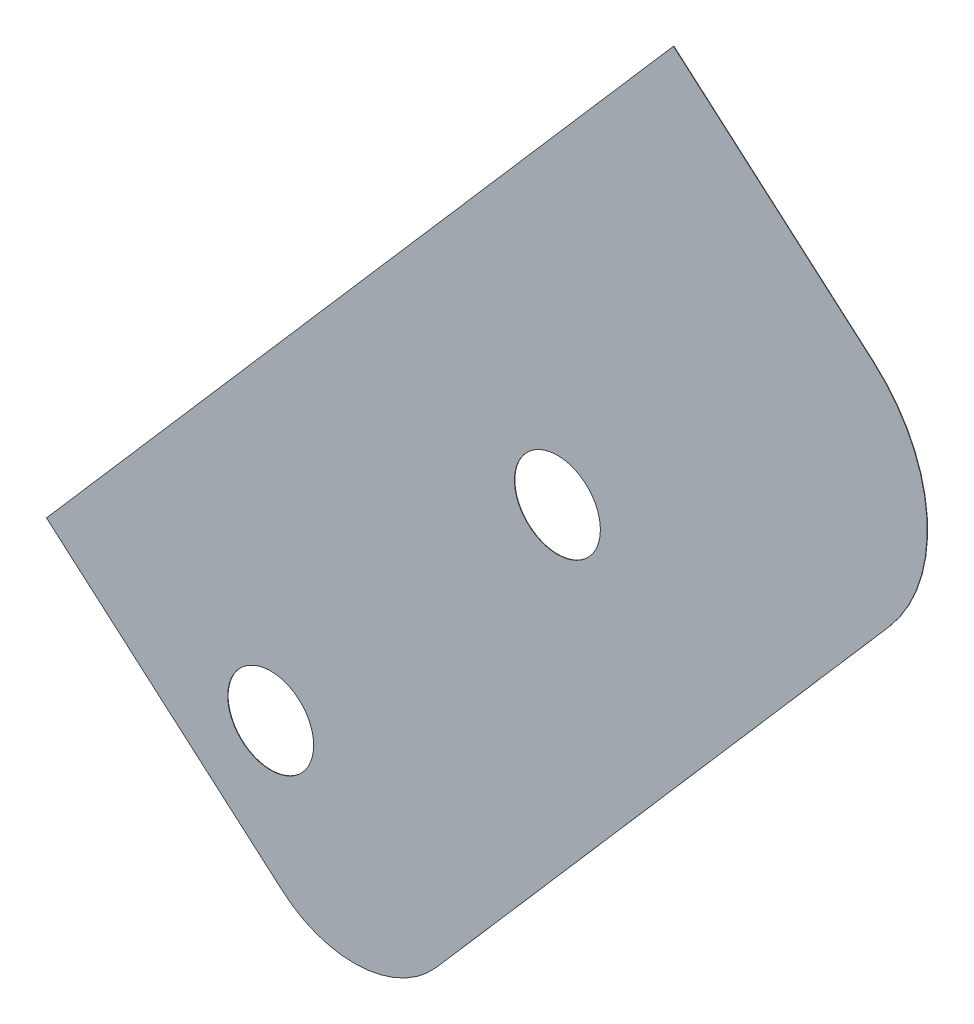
ISO-10303-21;
HEADER;
FILE_DESCRIPTION(('STEP AP214'),'2;1');
FILE_NAME('part.step','',(''),(''),'','','');
FILE_SCHEMA(('AUTOMOTIVE_DESIGN { 1 0 10303 214 1 1 1 1 }'));
ENDSEC;
DATA;
#1=APPLICATION_CONTEXT('core data for automotive mechanical design processes');
#2=APPLICATION_PROTOCOL_DEFINITION('international standard','automotive_design',2000,#1);
#3=PRODUCT_CONTEXT('',#1,'mechanical');
#4=PRODUCT('Part','Part','',(#3));
#5=PRODUCT_RELATED_PRODUCT_CATEGORY('part','',(#4));
#6=PRODUCT_DEFINITION_FORMATION('','',#4);
#7=PRODUCT_DEFINITION_CONTEXT('part definition',#1,'design');
#8=PRODUCT_DEFINITION('design','',#6,#7);
#9=PRODUCT_DEFINITION_SHAPE('','',#8);
#10=(LENGTH_UNIT() NAMED_UNIT(*) SI_UNIT(.MILLI.,.METRE.));
#11=(NAMED_UNIT(*) PLANE_ANGLE_UNIT() SI_UNIT($,.RADIAN.));
#12=(NAMED_UNIT(*) SI_UNIT($,.STERADIAN.) SOLID_ANGLE_UNIT());
#13=UNCERTAINTY_MEASURE_WITH_UNIT(LENGTH_MEASURE(1.E-05),#10,'distance_accuracy_value','');
#14=(GEOMETRIC_REPRESENTATION_CONTEXT(3) GLOBAL_UNCERTAINTY_ASSIGNED_CONTEXT((#13)) GLOBAL_UNIT_ASSIGNED_CONTEXT((#10,
#11,#12)) REPRESENTATION_CONTEXT('',''));
#15=CARTESIAN_POINT('',(0.,0.,0.));
#16=DIRECTION('',(0.,0.,1.));
#17=DIRECTION('',(1.,0.,0.));
#18=AXIS2_PLACEMENT_3D('',#15,#16,#17);
#19=CARTESIAN_POINT('',(-628.695624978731,-74.2116467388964,0.0254000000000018));
#20=DIRECTION('',(0.,0.,-1.));
#21=DIRECTION('',(-1.,0.,0.));
#22=AXIS2_PLACEMENT_3D('',#19,#20,#21);
#23=CYLINDRICAL_SURFACE('',#22,10.287);
#24=CARTESIAN_POINT('',(-628.695624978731,-74.2116467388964,0.));
#25=DIRECTION('',(0.,0.,1.));
#26=DIRECTION('',(1.,0.,0.));
#27=AXIS2_PLACEMENT_3D('',#24,#25,#26);
#28=CIRCLE('',#27,10.287);
#29=CARTESIAN_POINT('',(-620.928630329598,-80.9567311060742,0.));
#30=VERTEX_POINT('',#29);
#31=CARTESIAN_POINT('',(-621.950540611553,-66.4446520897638,0.));
#32=VERTEX_POINT('',#31);
#33=EDGE_CURVE('E135',#30,#32,#28,.T.);
#34=ORIENTED_EDGE('',*,*,#33,.T.);
#35=DIRECTION('',(0.,0.,-1.));
#36=VECTOR('',#35,1.);
#37=CARTESIAN_POINT('',(-621.950540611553,-66.4446520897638,0.0254000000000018));
#38=LINE('',#37,#36);
#39=CARTESIAN_POINT('',(-621.950540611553,-66.4446520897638,0.0254000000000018));
#40=VERTEX_POINT('',#39);
#41=EDGE_CURVE('E11',#40,#32,#38,.T.);
#42=ORIENTED_EDGE('',*,*,#41,.F.);
#43=CARTESIAN_POINT('',(-628.695624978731,-74.2116467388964,0.0254000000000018));
#44=DIRECTION('',(0.,0.,1.));
#45=DIRECTION('',(1.,0.,0.));
#46=AXIS2_PLACEMENT_3D('',#43,#44,#45);
#47=CIRCLE('',#46,10.287);
#48=CARTESIAN_POINT('',(-620.928630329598,-80.9567311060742,0.0254000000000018));
#49=VERTEX_POINT('',#48);
#50=EDGE_CURVE('E152',#49,#40,#47,.T.);
#51=ORIENTED_EDGE('',*,*,#50,.F.);
#52=DIRECTION('',(0.,0.,-1.));
#53=VECTOR('',#52,1.);
#54=CARTESIAN_POINT('',(-620.928630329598,-80.9567311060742,0.0254000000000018));
#55=LINE('',#54,#53);
#56=EDGE_CURVE('E131',#49,#30,#55,.T.);
#57=ORIENTED_EDGE('',*,*,#56,.T.);
#58=EDGE_LOOP('',(#34,#42,#51,#57));
#59=FACE_BOUND('',#58,.T.);
#60=ADVANCED_FACE('F45',(#59),#23,.T.);
#61=CARTESIAN_POINT('',(-621.950540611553,-66.4446520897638,0.0254000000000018));
#62=DIRECTION('',(-0.655690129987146,-0.755030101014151,0.));
#63=DIRECTION('',(0.755030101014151,-0.655690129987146,0.));
#64=AXIS2_PLACEMENT_3D('',#61,#62,#63);
#65=PLANE('',#64);
#66=DIRECTION('',(-0.755030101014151,0.655690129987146,0.));
#67=VECTOR('',#66,1.);
#68=CARTESIAN_POINT('',(-621.950540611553,-66.4446520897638,0.));
#69=LINE('',#68,#67);
#70=CARTESIAN_POINT('',(-634.991420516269,-55.1195721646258,0.));
#71=VERTEX_POINT('',#70);
#72=EDGE_CURVE('E139',#32,#71,#69,.T.);
#73=ORIENTED_EDGE('',*,*,#72,.T.);
#74=DIRECTION('',(0.,0.,-1.));
#75=VECTOR('',#74,1.);
#76=CARTESIAN_POINT('',(-634.991420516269,-55.1195721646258,0.0254000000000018));
#77=LINE('',#76,#75);
#78=CARTESIAN_POINT('',(-634.991420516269,-55.1195721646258,0.0254000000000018));
#79=VERTEX_POINT('',#78);
#80=EDGE_CURVE('E54',#79,#71,#77,.T.);
#81=ORIENTED_EDGE('',*,*,#80,.F.);
#82=DIRECTION('',(-0.755030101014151,0.655690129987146,0.));
#83=VECTOR('',#82,1.);
#84=CARTESIAN_POINT('',(-621.950540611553,-66.4446520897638,0.0254000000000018));
#85=LINE('',#84,#83);
#86=EDGE_CURVE('E99',#40,#79,#85,.T.);
#87=ORIENTED_EDGE('',*,*,#86,.F.);
#88=ORIENTED_EDGE('',*,*,#41,.T.);
#89=EDGE_LOOP('',(#73,#81,#87,#88));
#90=FACE_BOUND('',#89,.T.);
#91=ADVANCED_FACE('F182',(#90),#65,.F.);
#92=CARTESIAN_POINT('',(-634.991420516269,-55.1195721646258,0.0254000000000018));
#93=DIRECTION('',(0.755030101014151,-0.655690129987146,0.));
#94=DIRECTION('',(0.655690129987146,0.755030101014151,0.));
#95=AXIS2_PLACEMENT_3D('',#92,#93,#94);
#96=PLANE('',#95);
#97=DIRECTION('',(-0.655690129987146,-0.755030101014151,0.));
#98=VECTOR('',#97,1.);
#99=CARTESIAN_POINT('',(-634.991420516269,-55.1195721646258,0.));
#100=LINE('',#99,#98);
#101=CARTESIAN_POINT('',(-675.961562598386,-102.296872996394,0.));
#102=VERTEX_POINT('',#101);
#103=EDGE_CURVE('E143',#71,#102,#100,.T.);
#104=ORIENTED_EDGE('',*,*,#103,.T.);
#105=DIRECTION('',(0.,0.,-1.));
#106=VECTOR('',#105,1.);
#107=CARTESIAN_POINT('',(-675.961562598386,-102.296872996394,0.0254000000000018));
#108=LINE('',#107,#106);
#109=CARTESIAN_POINT('',(-675.961562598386,-102.296872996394,0.0254000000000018));
#110=VERTEX_POINT('',#109);
#111=EDGE_CURVE('E123',#110,#102,#108,.T.);
#112=ORIENTED_EDGE('',*,*,#111,.F.);
#113=DIRECTION('',(-0.655690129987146,-0.755030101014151,0.));
#114=VECTOR('',#113,1.);
#115=CARTESIAN_POINT('',(-634.991420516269,-55.1195721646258,0.0254000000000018));
#116=LINE('',#115,#114);
#117=EDGE_CURVE('E112',#79,#110,#116,.T.);
#118=ORIENTED_EDGE('',*,*,#117,.F.);
#119=ORIENTED_EDGE('',*,*,#80,.T.);
#120=EDGE_LOOP('',(#104,#112,#118,#119));
#121=FACE_BOUND('',#120,.T.);
#122=ADVANCED_FACE('F163',(#121),#96,.F.);
#123=CARTESIAN_POINT('',(-675.961562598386,-102.296872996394,0.0254000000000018));
#124=DIRECTION('',(0.655690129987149,0.755030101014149,0.));
#125=DIRECTION('',(-0.755030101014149,0.655690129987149,0.));
#126=AXIS2_PLACEMENT_3D('',#123,#124,#125);
#127=PLANE('',#126);
#128=DIRECTION('',(0.755030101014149,-0.655690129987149,0.));
#129=VECTOR('',#128,1.);
#130=CARTESIAN_POINT('',(-675.961562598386,-102.296872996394,0.));
#131=LINE('',#130,#129);
#132=CARTESIAN_POINT('',(-660.52346212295,-115.703769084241,0.));
#133=VERTEX_POINT('',#132);
#134=EDGE_CURVE('E121',#102,#133,#131,.T.);
#135=ORIENTED_EDGE('',*,*,#134,.T.);
#136=DIRECTION('',(0.,0.,-1.));
#137=VECTOR('',#136,1.);
#138=CARTESIAN_POINT('',(-660.52346212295,-115.703769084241,0.0254000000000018));
#139=LINE('',#138,#137);
#140=CARTESIAN_POINT('',(-660.52346212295,-115.703769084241,0.0254000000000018));
#141=VERTEX_POINT('',#140);
#142=EDGE_CURVE('E118',#141,#133,#139,.T.);
#143=ORIENTED_EDGE('',*,*,#142,.F.);
#144=DIRECTION('',(0.755030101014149,-0.655690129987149,0.));
#145=VECTOR('',#144,1.);
#146=CARTESIAN_POINT('',(-675.961562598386,-102.296872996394,0.0254000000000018));
#147=LINE('',#146,#145);
#148=EDGE_CURVE('E106',#110,#141,#147,.T.);
#149=ORIENTED_EDGE('',*,*,#148,.F.);
#150=ORIENTED_EDGE('',*,*,#111,.T.);
#151=EDGE_LOOP('',(#135,#143,#149,#150));
#152=FACE_BOUND('',#151,.T.);
#153=ADVANCED_FACE('F119',(#152),#127,.F.);
#154=CARTESIAN_POINT('',(-655.860193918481,-110.333995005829,0.0254000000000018));
#155=DIRECTION('',(0.,0.,-1.));
#156=DIRECTION('',(-1.,0.,0.));
#157=AXIS2_PLACEMENT_3D('',#154,#155,#156);
#158=CYLINDRICAL_SURFACE('',#157,7.11200000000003);
#159=CARTESIAN_POINT('',(-655.860193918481,-110.333995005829,0.));
#160=DIRECTION('',(0.,0.,1.));
#161=DIRECTION('',(1.,0.,0.));
#162=AXIS2_PLACEMENT_3D('',#159,#160,#161);
#163=CIRCLE('',#162,7.11200000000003);
#164=CARTESIAN_POINT('',(-650.490419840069,-114.997263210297,0.));
#165=VERTEX_POINT('',#164);
#166=EDGE_CURVE('E85',#133,#165,#163,.T.);
#167=ORIENTED_EDGE('',*,*,#166,.T.);
#168=DIRECTION('',(0.,0.,-1.));
#169=VECTOR('',#168,1.);
#170=CARTESIAN_POINT('',(-650.490419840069,-114.997263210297,0.0254000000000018));
#171=LINE('',#170,#169);
#172=CARTESIAN_POINT('',(-650.490419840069,-114.997263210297,0.0254000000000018));
#173=VERTEX_POINT('',#172);
#174=EDGE_CURVE('E124',#173,#165,#171,.T.);
#175=ORIENTED_EDGE('',*,*,#174,.F.);
#176=CARTESIAN_POINT('',(-655.860193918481,-110.333995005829,0.0254000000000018));
#177=DIRECTION('',(0.,0.,1.));
#178=DIRECTION('',(1.,0.,0.));
#179=AXIS2_PLACEMENT_3D('',#176,#177,#178);
#180=CIRCLE('',#179,7.11200000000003);
#181=EDGE_CURVE('E110',#141,#173,#180,.T.);
#182=ORIENTED_EDGE('',*,*,#181,.F.);
#183=ORIENTED_EDGE('',*,*,#142,.T.);
#184=EDGE_LOOP('',(#167,#175,#182,#183));
#185=FACE_BOUND('',#184,.T.);
#186=ADVANCED_FACE('F126',(#185),#158,.T.);
#187=CARTESIAN_POINT('',(-650.490419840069,-114.997263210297,0.0254000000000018));
#188=DIRECTION('',(-0.755030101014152,0.655690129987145,0.));
#189=DIRECTION('',(-0.655690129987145,-0.755030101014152,0.));
#190=AXIS2_PLACEMENT_3D('',#187,#188,#189);
#191=PLANE('',#190);
#192=DIRECTION('',(0.655690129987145,0.755030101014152,0.));
#193=VECTOR('',#192,1.);
#194=CARTESIAN_POINT('',(-650.490419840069,-114.997263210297,0.));
#195=LINE('',#194,#193);
#196=EDGE_CURVE('E91',#165,#30,#195,.T.);
#197=ORIENTED_EDGE('',*,*,#196,.T.);
#198=ORIENTED_EDGE('',*,*,#56,.F.);
#199=DIRECTION('',(0.655690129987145,0.755030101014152,0.));
#200=VECTOR('',#199,1.);
#201=CARTESIAN_POINT('',(-650.490419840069,-114.997263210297,0.0254000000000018));
#202=LINE('',#201,#200);
#203=EDGE_CURVE('E62',#173,#49,#202,.T.);
#204=ORIENTED_EDGE('',*,*,#203,.F.);
#205=ORIENTED_EDGE('',*,*,#174,.T.);
#206=EDGE_LOOP('',(#197,#198,#204,#205));
#207=FACE_BOUND('',#206,.T.);
#208=ADVANCED_FACE('F170',(#207),#191,.F.);
#209=CARTESIAN_POINT('',(-628.695624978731,-74.2116467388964,0.0254000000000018));
#210=DIRECTION('',(0.,0.,1.));
#211=DIRECTION('',(1.,0.,0.));
#212=AXIS2_PLACEMENT_3D('',#209,#210,#211);
#213=PLANE('',#212);
#214=CARTESIAN_POINT('',(-661.310720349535,-106.441625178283,0.0254000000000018));
#215=DIRECTION('',(0.,0.,1.));
#216=DIRECTION('',(1.,0.,0.));
#217=AXIS2_PLACEMENT_3D('',#214,#215,#216);
#218=CIRCLE('',#217,2.80670000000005);
#219=CARTESIAN_POINT('',(-658.504020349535,-106.441625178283,0.0254000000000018));
#220=VERTEX_POINT('',#219);
#221=EDGE_CURVE('E253',#220,#220,#218,.T.);
#222=ORIENTED_EDGE('',*,*,#221,.F.);
#223=EDGE_LOOP('',(#222));
#224=FACE_BOUND('',#223,.T.);
#225=CARTESIAN_POINT('',(-642.574374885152,-84.8666400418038,0.0254000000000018));
#226=DIRECTION('',(0.,0.,1.));
#227=DIRECTION('',(1.,0.,0.));
#228=AXIS2_PLACEMENT_3D('',#225,#226,#227);
#229=CIRCLE('',#228,2.80670000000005);
#230=CARTESIAN_POINT('',(-639.767674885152,-84.8666400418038,0.0254000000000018));
#231=VERTEX_POINT('',#230);
#232=EDGE_CURVE('E140',#231,#231,#229,.T.);
#233=ORIENTED_EDGE('',*,*,#232,.F.);
#234=EDGE_LOOP('',(#233));
#235=FACE_BOUND('',#234,.T.);
#236=ORIENTED_EDGE('',*,*,#50,.T.);
#237=ORIENTED_EDGE('',*,*,#86,.T.);
#238=ORIENTED_EDGE('',*,*,#117,.T.);
#239=ORIENTED_EDGE('',*,*,#148,.T.);
#240=ORIENTED_EDGE('',*,*,#181,.T.);
#241=ORIENTED_EDGE('',*,*,#203,.T.);
#242=EDGE_LOOP('',(#236,#237,#238,#239,#240,#241));
#243=FACE_BOUND('',#242,.T.);
#244=ADVANCED_FACE('F108',(#224,#235,#243),#213,.T.);
#245=CARTESIAN_POINT('',(-628.695624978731,-74.2116467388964,0.));
#246=DIRECTION('',(0.,0.,1.));
#247=DIRECTION('',(1.,0.,0.));
#248=AXIS2_PLACEMENT_3D('',#245,#246,#247);
#249=PLANE('',#248);
#250=CARTESIAN_POINT('',(-661.310720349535,-106.441625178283,0.));
#251=DIRECTION('',(0.,0.,1.));
#252=DIRECTION('',(1.,0.,0.));
#253=AXIS2_PLACEMENT_3D('',#250,#251,#252);
#254=CIRCLE('',#253,2.80670000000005);
#255=CARTESIAN_POINT('',(-658.504020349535,-106.441625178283,0.));
#256=VERTEX_POINT('',#255);
#257=EDGE_CURVE('E250',#256,#256,#254,.T.);
#258=ORIENTED_EDGE('',*,*,#257,.T.);
#259=EDGE_LOOP('',(#258));
#260=FACE_BOUND('',#259,.T.);
#261=CARTESIAN_POINT('',(-642.574374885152,-84.8666400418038,0.));
#262=DIRECTION('',(0.,0.,1.));
#263=DIRECTION('',(1.,0.,0.));
#264=AXIS2_PLACEMENT_3D('',#261,#262,#263);
#265=CIRCLE('',#264,2.80670000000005);
#266=CARTESIAN_POINT('',(-639.767674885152,-84.8666400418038,0.));
#267=VERTEX_POINT('',#266);
#268=EDGE_CURVE('E255',#267,#267,#265,.T.);
#269=ORIENTED_EDGE('',*,*,#268,.T.);
#270=EDGE_LOOP('',(#269));
#271=FACE_BOUND('',#270,.T.);
#272=ORIENTED_EDGE('',*,*,#33,.F.);
#273=ORIENTED_EDGE('',*,*,#196,.F.);
#274=ORIENTED_EDGE('',*,*,#166,.F.);
#275=ORIENTED_EDGE('',*,*,#134,.F.);
#276=ORIENTED_EDGE('',*,*,#103,.F.);
#277=ORIENTED_EDGE('',*,*,#72,.F.);
#278=EDGE_LOOP('',(#272,#273,#274,#275,#276,#277));
#279=FACE_BOUND('',#278,.T.);
#280=ADVANCED_FACE('F166',(#260,#271,#279),#249,.F.);
#281=CARTESIAN_POINT('',(-642.574374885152,-84.8666400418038,0.0254000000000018));
#282=DIRECTION('',(0.,0.,1.));
#283=DIRECTION('',(1.,0.,0.));
#284=AXIS2_PLACEMENT_3D('',#281,#282,#283);
#285=CYLINDRICAL_SURFACE('',#284,2.80670000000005);
#286=ORIENTED_EDGE('',*,*,#268,.F.);
#287=EDGE_LOOP('',(#286));
#288=FACE_BOUND('',#287,.T.);
#289=ORIENTED_EDGE('',*,*,#232,.T.);
#290=EDGE_LOOP('',(#289));
#291=FACE_BOUND('',#290,.T.);
#292=ADVANCED_FACE('F221',(#288,#291),#285,.F.);
#293=CARTESIAN_POINT('',(-661.310720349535,-106.441625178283,0.0254000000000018));
#294=DIRECTION('',(0.,0.,1.));
#295=DIRECTION('',(1.,0.,0.));
#296=AXIS2_PLACEMENT_3D('',#293,#294,#295);
#297=CYLINDRICAL_SURFACE('',#296,2.80670000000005);
#298=ORIENTED_EDGE('',*,*,#257,.F.);
#299=EDGE_LOOP('',(#298));
#300=FACE_BOUND('',#299,.T.);
#301=ORIENTED_EDGE('',*,*,#221,.T.);
#302=EDGE_LOOP('',(#301));
#303=FACE_BOUND('',#302,.T.);
#304=ADVANCED_FACE('F231',(#300,#303),#297,.F.);
#305=CLOSED_SHELL('',(#60,#91,#122,#153,#186,#208,#244,#280,#292,#304));
#306=MANIFOLD_SOLID_BREP('B2',#305);
#307=ADVANCED_BREP_SHAPE_REPRESENTATION('',(#18,#306),#14);
#308=SHAPE_DEFINITION_REPRESENTATION(#9,#307);
ENDSEC;
END-ISO-10303-21;
